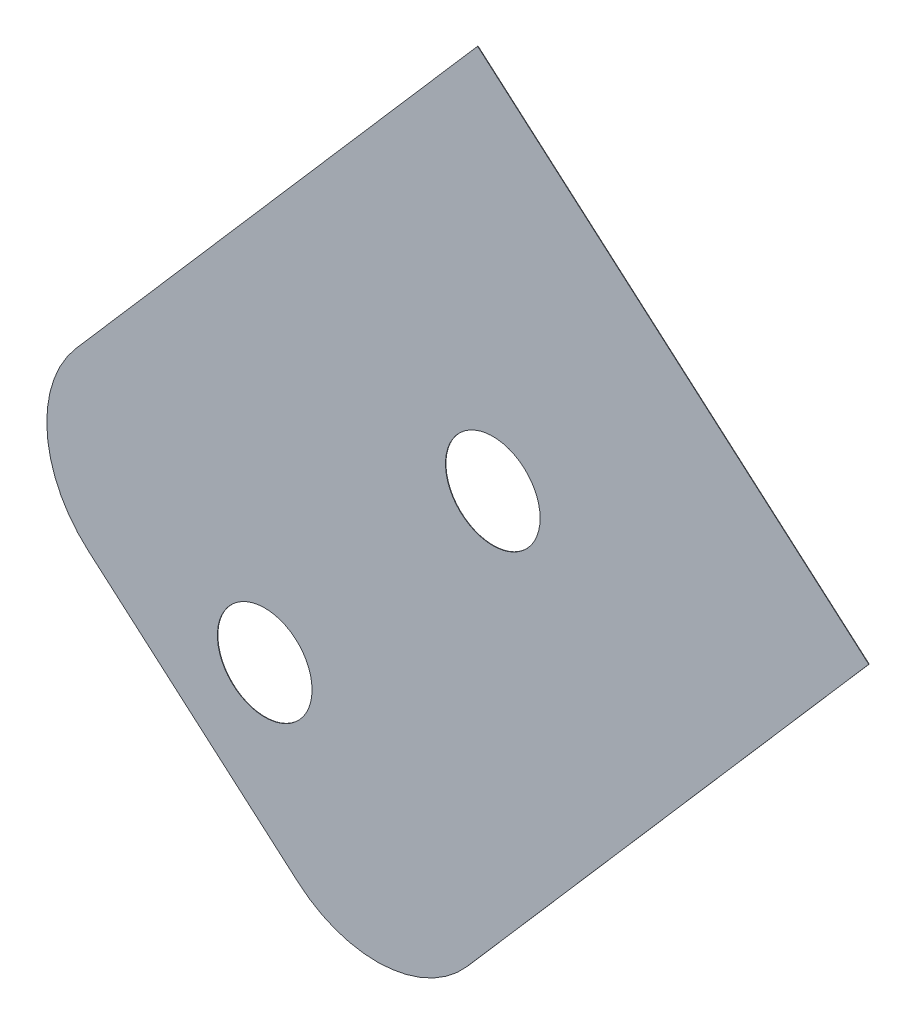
from build123d import *

# Parameters (mm, degrees)
BOSS_EXTRUDE1_DEPTH = 0.0254
HOLE1_D             = 5.6134


with BuildPart() as part:
    # Sketch1 → Boss-Extrude1 (new body)
    with BuildSketch(Plane.XY):
        with BuildLine():
            Line((-659.094108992, -81.324412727), (-682.299204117, -61.172432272))
            Line((-682.299204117, -61.172432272), (-706.115181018, -88.596635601))
            ThreePointArc((-706.115181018, -88.596635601), (-707.839839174, -93.7594789), (-705.408675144, -98.629677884))
            Line((-705.408675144, -98.629677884), (-692.943128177, -109.45512193))
            ThreePointArc((-692.943128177, -109.45512193), (-687.780284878, -111.179780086), (-682.910085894, -108.748616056))
            Line((-682.910085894, -108.748616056), (-659.094108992, -81.324412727))
        make_face()
    extrude(amount=BOSS_EXTRUDE1_DEPTH)

    # Hole1 (through all)
    with Locations(Plane(origin=(-685.051452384, -72.968995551, 0.0254), x_dir=(1, 0, 0), z_dir=(0, 0, 1))):
        with Locations((3.654260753, -10.601140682), (-9.877544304, -26.183074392)):
            Hole(HOLE1_D / 2)


solid = part.part
